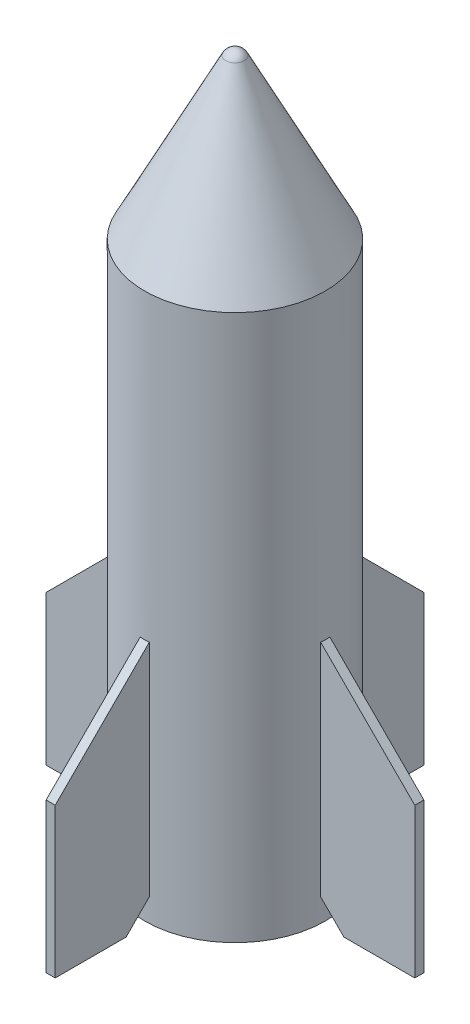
from build123d import *

# Parameters (mm, degrees)
SKETCH1_R           = 49.673
BOSS_EXTRUDE1_DEPTH = 300
BOSS_EXTRUDE2_DEPTH = 2.5
CIRPATTERN1_COUNT   = 4


with BuildPart() as part:
    # Sketch1 → Boss-Extrude1 (new body)
    with BuildSketch(Plane(origin=(0, 0, 0), x_dir=(1, 0, 0), z_dir=(0, 1, 0))):
        with Locations(Location((0, 0, 0), (0, 0, 270))):
            Circle(SKETCH1_R)
    extrude(amount=BOSS_EXTRUDE1_DEPTH)

    # Sketch2 → Revolve1 (revolve)
    with BuildSketch(Plane.XY, mode=Mode.PRIVATE) as revolve1_sk:
        with BuildLine():
            Line((0, 300), (0, 390.561))
            ThreePointArc((0, 390.561), (-3.009588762, 389.712209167), (-5.132194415, 387.415991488))
            Line((-5.132194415, 387.415991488), (-49.673, 300))
            Line((-49.673, 300), (0, 300))
        make_face()
    revolve(revolve1_sk.sketch.rotate(Axis((0, 300, 0), (0, 1, 0)), 270), axis=Axis((0, 300, 0), (0, 1, 0)))

    # Sketch3 → Boss-Extrude2 (add, symmetric)
    with BuildSketch(Plane.XY):
        Polygon((-43.249891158, 140.363898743), (-101.341288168, 82.272501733), (-101.341288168, 0), (-62.374085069, 0), (-43.249891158, 19.124193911), align=None)
    boss_extrude2 = extrude(amount=BOSS_EXTRUDE2_DEPTH, both=True)

    # CirPattern1: Boss-Extrude2 ×4 about axis
    cirpattern1_axis = Axis((0, 0, 0), (0, 1, 0))
    for i in range(1, CIRPATTERN1_COUNT):
        add(boss_extrude2.rotate(cirpattern1_axis, i * 360 / CIRPATTERN1_COUNT))


solid = part.part
